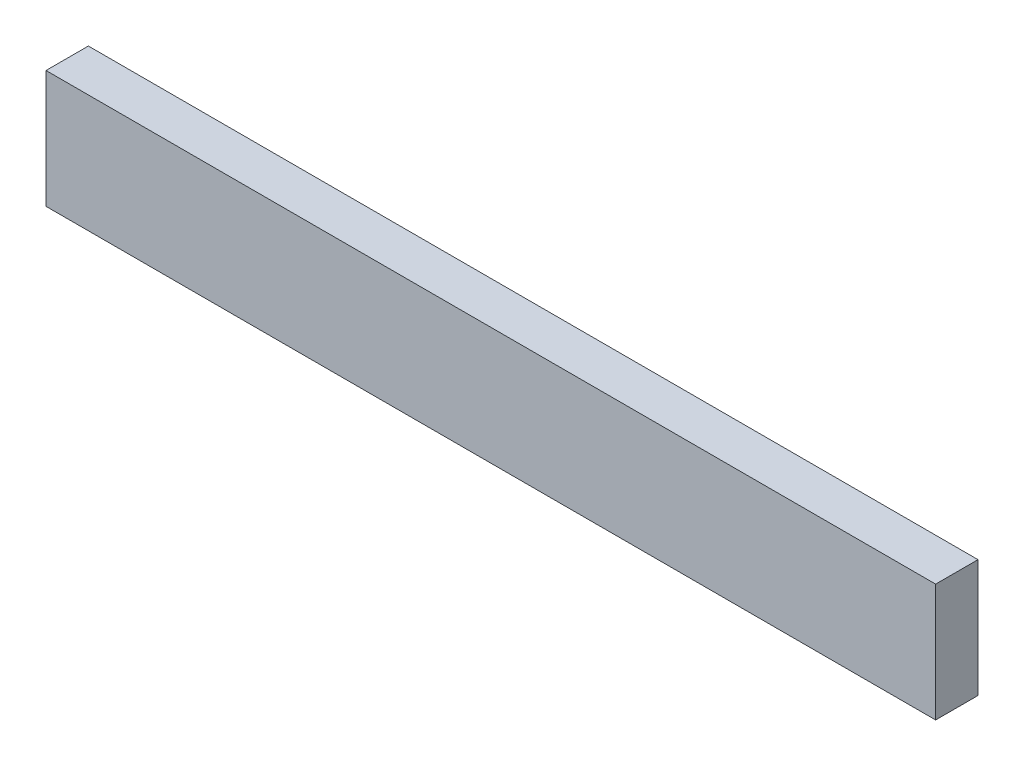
from build123d import *

# Parameters (mm, degrees)
ESQUISSE1_W        = 378
ESQUISSE1_H        = 50
BOSS_EXTRU_1_DEPTH = 18


with BuildPart() as part:
    # Esquisse1 → Boss.-Extru.1 (new body)
    with BuildSketch(Plane.XY):
        Rectangle(ESQUISSE1_W, ESQUISSE1_H)
    extrude(amount=BOSS_EXTRU_1_DEPTH)


solid = part.part
